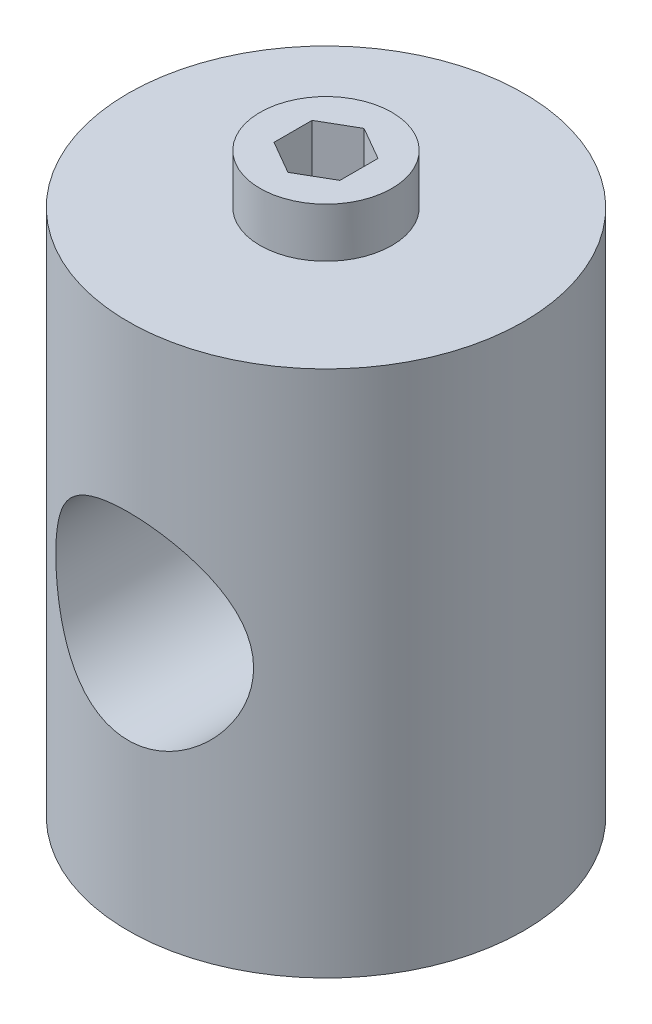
ISO-10303-21;
HEADER;
FILE_DESCRIPTION(('STEP AP214'),'2;1');
FILE_NAME('part.step','',(''),(''),'','','');
FILE_SCHEMA(('AUTOMOTIVE_DESIGN { 1 0 10303 214 1 1 1 1 }'));
ENDSEC;
DATA;
#1=APPLICATION_CONTEXT('core data for automotive mechanical design processes');
#2=APPLICATION_PROTOCOL_DEFINITION('international standard','automotive_design',2000,#1);
#3=PRODUCT_CONTEXT('',#1,'mechanical');
#4=PRODUCT('Part','Part','',(#3));
#5=PRODUCT_RELATED_PRODUCT_CATEGORY('part','',(#4));
#6=PRODUCT_DEFINITION_FORMATION('','',#4);
#7=PRODUCT_DEFINITION_CONTEXT('part definition',#1,'design');
#8=PRODUCT_DEFINITION('design','',#6,#7);
#9=PRODUCT_DEFINITION_SHAPE('','',#8);
#10=(LENGTH_UNIT() NAMED_UNIT(*) SI_UNIT(.MILLI.,.METRE.));
#11=(NAMED_UNIT(*) PLANE_ANGLE_UNIT() SI_UNIT($,.RADIAN.));
#12=(NAMED_UNIT(*) SI_UNIT($,.STERADIAN.) SOLID_ANGLE_UNIT());
#13=UNCERTAINTY_MEASURE_WITH_UNIT(LENGTH_MEASURE(1.E-05),#10,'distance_accuracy_value','');
#14=(GEOMETRIC_REPRESENTATION_CONTEXT(3) GLOBAL_UNCERTAINTY_ASSIGNED_CONTEXT((#13)) GLOBAL_UNIT_ASSIGNED_CONTEXT((#10,
#11,#12)) REPRESENTATION_CONTEXT('',''));
#15=CARTESIAN_POINT('',(0.,0.,0.));
#16=DIRECTION('',(0.,0.,1.));
#17=DIRECTION('',(1.,0.,0.));
#18=AXIS2_PLACEMENT_3D('',#15,#16,#17);
#19=CARTESIAN_POINT('',(-1.,8.,0.577350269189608));
#20=DIRECTION('',(0.,-1.,0.));
#21=DIRECTION('',(0.,0.,-1.));
#22=AXIS2_PLACEMENT_3D('',#19,#20,#21);
#23=PLANE('',#22);
#24=DIRECTION('',(0.866025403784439,0.,0.5));
#25=VECTOR('',#24,1.);
#26=CARTESIAN_POINT('',(-1.,8.,0.577350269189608));
#27=LINE('',#26,#25);
#28=CARTESIAN_POINT('',(-1.,8.,0.577350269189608));
#29=VERTEX_POINT('',#28);
#30=CARTESIAN_POINT('',(0.,8.,1.15470053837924));
#31=VERTEX_POINT('',#30);
#32=EDGE_CURVE('E103',#29,#31,#27,.T.);
#33=ORIENTED_EDGE('',*,*,#32,.T.);
#34=DIRECTION('',(0.866025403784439,0.,-0.5));
#35=VECTOR('',#34,1.);
#36=CARTESIAN_POINT('',(0.,8.,1.15470053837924));
#37=LINE('',#36,#35);
#38=CARTESIAN_POINT('',(1.,8.,0.577350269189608));
#39=VERTEX_POINT('',#38);
#40=EDGE_CURVE('E105',#31,#39,#37,.T.);
#41=ORIENTED_EDGE('',*,*,#40,.T.);
#42=DIRECTION('',(0.,0.,-1.));
#43=VECTOR('',#42,1.);
#44=CARTESIAN_POINT('',(1.,8.,0.577350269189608));
#45=LINE('',#44,#43);
#46=CARTESIAN_POINT('',(1.,8.,-0.577350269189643));
#47=VERTEX_POINT('',#46);
#48=EDGE_CURVE('E78',#39,#47,#45,.T.);
#49=ORIENTED_EDGE('',*,*,#48,.T.);
#50=DIRECTION('',(-0.866025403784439,0.,-0.5));
#51=VECTOR('',#50,1.);
#52=CARTESIAN_POINT('',(1.,8.,-0.577350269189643));
#53=LINE('',#52,#51);
#54=CARTESIAN_POINT('',(0.,8.,-1.15470053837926));
#55=VERTEX_POINT('',#54);
#56=EDGE_CURVE('E108',#47,#55,#53,.T.);
#57=ORIENTED_EDGE('',*,*,#56,.T.);
#58=DIRECTION('',(-0.866025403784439,0.,0.5));
#59=VECTOR('',#58,1.);
#60=CARTESIAN_POINT('',(0.,8.,-1.15470053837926));
#61=LINE('',#60,#59);
#62=CARTESIAN_POINT('',(-1.,8.,-0.577350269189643));
#63=VERTEX_POINT('',#62);
#64=EDGE_CURVE('E110',#55,#63,#61,.T.);
#65=ORIENTED_EDGE('',*,*,#64,.T.);
#66=DIRECTION('',(0.,0.,1.));
#67=VECTOR('',#66,1.);
#68=CARTESIAN_POINT('',(-1.,8.,-0.577350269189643));
#69=LINE('',#68,#67);
#70=EDGE_CURVE('E38',#63,#29,#69,.T.);
#71=ORIENTED_EDGE('',*,*,#70,.T.);
#72=EDGE_LOOP('',(#33,#41,#49,#57,#65,#71));
#73=FACE_BOUND('',#72,.T.);
#74=ADVANCED_FACE('F14',(#73),#23,.F.);
#75=CARTESIAN_POINT('',(0.,8.,1.15470053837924));
#76=DIRECTION('',(0.5,0.,0.866025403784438));
#77=DIRECTION('',(0.866025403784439,0.,-0.5));
#78=AXIS2_PLACEMENT_3D('',#75,#76,#77);
#79=PLANE('',#78);
#80=DIRECTION('',(0.866025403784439,0.,-0.5));
#81=VECTOR('',#80,1.);
#82=CARTESIAN_POINT('',(0.,9.5,1.15470053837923));
#83=LINE('',#82,#81);
#84=CARTESIAN_POINT('',(0.,9.5,1.15470053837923));
#85=VERTEX_POINT('',#84);
#86=CARTESIAN_POINT('',(1.,9.5,0.577350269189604));
#87=VERTEX_POINT('',#86);
#88=EDGE_CURVE('E84',#85,#87,#83,.T.);
#89=ORIENTED_EDGE('',*,*,#88,.T.);
#90=DIRECTION('',(0.,1.,0.));
#91=VECTOR('',#90,1.);
#92=CARTESIAN_POINT('',(1.,8.,0.577350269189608));
#93=LINE('',#92,#91);
#94=EDGE_CURVE('E71',#39,#87,#93,.T.);
#95=ORIENTED_EDGE('',*,*,#94,.F.);
#96=ORIENTED_EDGE('',*,*,#40,.F.);
#97=DIRECTION('',(0.,1.,0.));
#98=VECTOR('',#97,1.);
#99=CARTESIAN_POINT('',(0.,8.,1.15470053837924));
#100=LINE('',#99,#98);
#101=EDGE_CURVE('E81',#31,#85,#100,.T.);
#102=ORIENTED_EDGE('',*,*,#101,.T.);
#103=EDGE_LOOP('',(#89,#95,#96,#102));
#104=FACE_BOUND('',#103,.T.);
#105=ADVANCED_FACE('F85',(#104),#79,.F.);
#106=CARTESIAN_POINT('',(1.,8.,0.577350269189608));
#107=DIRECTION('',(1.,0.,0.));
#108=DIRECTION('',(0.,0.,-1.));
#109=AXIS2_PLACEMENT_3D('',#106,#107,#108);
#110=PLANE('',#109);
#111=DIRECTION('',(0.,0.,-1.));
#112=VECTOR('',#111,1.);
#113=CARTESIAN_POINT('',(1.,9.5,0.577350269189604));
#114=LINE('',#113,#112);
#115=CARTESIAN_POINT('',(1.,9.5,-0.577350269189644));
#116=VERTEX_POINT('',#115);
#117=EDGE_CURVE('E76',#87,#116,#114,.T.);
#118=ORIENTED_EDGE('',*,*,#117,.T.);
#119=DIRECTION('',(0.,1.,0.));
#120=VECTOR('',#119,1.);
#121=CARTESIAN_POINT('',(1.,8.,-0.577350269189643));
#122=LINE('',#121,#120);
#123=EDGE_CURVE('E80',#47,#116,#122,.T.);
#124=ORIENTED_EDGE('',*,*,#123,.F.);
#125=ORIENTED_EDGE('',*,*,#48,.F.);
#126=ORIENTED_EDGE('',*,*,#94,.T.);
#127=EDGE_LOOP('',(#118,#124,#125,#126));
#128=FACE_BOUND('',#127,.T.);
#129=ADVANCED_FACE('F73',(#128),#110,.F.);
#130=CARTESIAN_POINT('',(1.,8.,-0.577350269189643));
#131=DIRECTION('',(0.5,0.,-0.866025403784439));
#132=DIRECTION('',(-0.866025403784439,0.,-0.5));
#133=AXIS2_PLACEMENT_3D('',#130,#131,#132);
#134=PLANE('',#133);
#135=DIRECTION('',(-0.866025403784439,0.,-0.5));
#136=VECTOR('',#135,1.);
#137=CARTESIAN_POINT('',(1.,9.5,-0.577350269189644));
#138=LINE('',#137,#136);
#139=CARTESIAN_POINT('',(0.,9.5,-1.15470053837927));
#140=VERTEX_POINT('',#139);
#141=EDGE_CURVE('E92',#116,#140,#138,.T.);
#142=ORIENTED_EDGE('',*,*,#141,.T.);
#143=DIRECTION('',(0.,1.,0.));
#144=VECTOR('',#143,1.);
#145=CARTESIAN_POINT('',(0.,8.,-1.15470053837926));
#146=LINE('',#145,#144);
#147=EDGE_CURVE('E117',#55,#140,#146,.T.);
#148=ORIENTED_EDGE('',*,*,#147,.F.);
#149=ORIENTED_EDGE('',*,*,#56,.F.);
#150=ORIENTED_EDGE('',*,*,#123,.T.);
#151=EDGE_LOOP('',(#142,#148,#149,#150));
#152=FACE_BOUND('',#151,.T.);
#153=ADVANCED_FACE('F162',(#152),#134,.F.);
#154=CARTESIAN_POINT('',(0.,8.,-1.15470053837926));
#155=DIRECTION('',(-0.5,0.,-0.866025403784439));
#156=DIRECTION('',(-0.866025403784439,0.,0.5));
#157=AXIS2_PLACEMENT_3D('',#154,#155,#156);
#158=PLANE('',#157);
#159=DIRECTION('',(-0.866025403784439,0.,0.5));
#160=VECTOR('',#159,1.);
#161=CARTESIAN_POINT('',(0.,9.5,-1.15470053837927));
#162=LINE('',#161,#160);
#163=CARTESIAN_POINT('',(-1.,9.5,-0.577350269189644));
#164=VERTEX_POINT('',#163);
#165=EDGE_CURVE('E94',#140,#164,#162,.T.);
#166=ORIENTED_EDGE('',*,*,#165,.T.);
#167=DIRECTION('',(0.,1.,0.));
#168=VECTOR('',#167,1.);
#169=CARTESIAN_POINT('',(-1.,8.,-0.577350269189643));
#170=LINE('',#169,#168);
#171=EDGE_CURVE('E115',#63,#164,#170,.T.);
#172=ORIENTED_EDGE('',*,*,#171,.F.);
#173=ORIENTED_EDGE('',*,*,#64,.F.);
#174=ORIENTED_EDGE('',*,*,#147,.T.);
#175=EDGE_LOOP('',(#166,#172,#173,#174));
#176=FACE_BOUND('',#175,.T.);
#177=ADVANCED_FACE('F158',(#176),#158,.F.);
#178=CARTESIAN_POINT('',(-1.,8.,0.577350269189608));
#179=DIRECTION('',(-0.5,0.,0.866025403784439));
#180=DIRECTION('',(0.866025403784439,0.,0.5));
#181=AXIS2_PLACEMENT_3D('',#178,#179,#180);
#182=PLANE('',#181);
#183=DIRECTION('',(0.866025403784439,0.,0.5));
#184=VECTOR('',#183,1.);
#185=CARTESIAN_POINT('',(-1.,9.5,0.577350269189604));
#186=LINE('',#185,#184);
#187=CARTESIAN_POINT('',(-1.,9.5,0.577350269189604));
#188=VERTEX_POINT('',#187);
#189=EDGE_CURVE('E30',#188,#85,#186,.T.);
#190=ORIENTED_EDGE('',*,*,#189,.T.);
#191=ORIENTED_EDGE('',*,*,#101,.F.);
#192=ORIENTED_EDGE('',*,*,#32,.F.);
#193=DIRECTION('',(0.,1.,0.));
#194=VECTOR('',#193,1.);
#195=CARTESIAN_POINT('',(-1.,8.,0.577350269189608));
#196=LINE('',#195,#194);
#197=EDGE_CURVE('E113',#29,#188,#196,.T.);
#198=ORIENTED_EDGE('',*,*,#197,.T.);
#199=EDGE_LOOP('',(#190,#191,#192,#198));
#200=FACE_BOUND('',#199,.T.);
#201=ADVANCED_FACE('F161',(#200),#182,.F.);
#202=CARTESIAN_POINT('',(0.,9.5,0.));
#203=DIRECTION('',(0.,-1.,0.));
#204=DIRECTION('',(0.,0.,-1.));
#205=AXIS2_PLACEMENT_3D('',#202,#203,#204);
#206=PLANE('',#205);
#207=ORIENTED_EDGE('',*,*,#88,.F.);
#208=ORIENTED_EDGE('',*,*,#189,.F.);
#209=DIRECTION('',(0.,0.,1.));
#210=VECTOR('',#209,1.);
#211=CARTESIAN_POINT('',(-1.,9.5,-0.577350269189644));
#212=LINE('',#211,#210);
#213=EDGE_CURVE('E100',#164,#188,#212,.T.);
#214=ORIENTED_EDGE('',*,*,#213,.F.);
#215=ORIENTED_EDGE('',*,*,#165,.F.);
#216=ORIENTED_EDGE('',*,*,#141,.F.);
#217=ORIENTED_EDGE('',*,*,#117,.F.);
#218=EDGE_LOOP('',(#207,#208,#214,#215,#216,#217));
#219=FACE_BOUND('',#218,.T.);
#220=CARTESIAN_POINT('',(0.,9.5,0.));
#221=DIRECTION('',(0.,-1.,0.));
#222=DIRECTION('',(0.,0.,-1.));
#223=AXIS2_PLACEMENT_3D('',#220,#221,#222);
#224=CIRCLE('',#223,2.);
#225=CARTESIAN_POINT('',(0.,9.5,-2.00000000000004));
#226=VERTEX_POINT('',#225);
#227=EDGE_CURVE('E23',#226,#226,#224,.T.);
#228=ORIENTED_EDGE('',*,*,#227,.F.);
#229=EDGE_LOOP('',(#228));
#230=FACE_BOUND('',#229,.T.);
#231=ADVANCED_FACE('F88',(#219,#230),#206,.F.);
#232=CARTESIAN_POINT('',(-1.,8.,-0.577350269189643));
#233=DIRECTION('',(-1.,0.,0.));
#234=DIRECTION('',(0.,0.,1.));
#235=AXIS2_PLACEMENT_3D('',#232,#233,#234);
#236=PLANE('',#235);
#237=ORIENTED_EDGE('',*,*,#213,.T.);
#238=ORIENTED_EDGE('',*,*,#197,.F.);
#239=ORIENTED_EDGE('',*,*,#70,.F.);
#240=ORIENTED_EDGE('',*,*,#171,.T.);
#241=EDGE_LOOP('',(#237,#238,#239,#240));
#242=FACE_BOUND('',#241,.T.);
#243=ADVANCED_FACE('F153',(#242),#236,.F.);
#244=CARTESIAN_POINT('',(0.,5.5,0.));
#245=DIRECTION('',(0.,-1.,0.));
#246=DIRECTION('',(0.,0.,-1.));
#247=AXIS2_PLACEMENT_3D('',#244,#245,#246);
#248=CYLINDRICAL_SURFACE('',#247,2.);
#249=ORIENTED_EDGE('',*,*,#227,.T.);
#250=EDGE_LOOP('',(#249));
#251=FACE_BOUND('',#250,.T.);
#252=CARTESIAN_POINT('',(0.,8.,0.));
#253=DIRECTION('',(0.,-1.,0.));
#254=DIRECTION('',(0.,0.,1.));
#255=AXIS2_PLACEMENT_3D('',#252,#253,#254);
#256=CIRCLE('',#255,2.);
#257=CARTESIAN_POINT('',(0.,8.,1.99999999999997));
#258=VERTEX_POINT('',#257);
#259=EDGE_CURVE('E9',#258,#258,#256,.T.);
#260=ORIENTED_EDGE('',*,*,#259,.F.);
#261=EDGE_LOOP('',(#260));
#262=FACE_BOUND('',#261,.T.);
#263=ADVANCED_FACE('F156',(#251,#262),#248,.T.);
#264=CARTESIAN_POINT('',(0.,-8.,0.));
#265=DIRECTION('',(0.,-1.,0.));
#266=DIRECTION('',(1.,0.,0.));
#267=AXIS2_PLACEMENT_3D('',#264,#265,#266);
#268=PLANE('',#267);
#269=CARTESIAN_POINT('',(0.,-8.,0.));
#270=DIRECTION('',(0.,1.,0.));
#271=DIRECTION('',(-1.,0.,0.));
#272=AXIS2_PLACEMENT_3D('',#269,#270,#271);
#273=CIRCLE('',#272,6.);
#274=CARTESIAN_POINT('',(-6.,-8.,0.));
#275=VERTEX_POINT('',#274);
#276=EDGE_CURVE('E123',#275,#275,#273,.T.);
#277=ORIENTED_EDGE('',*,*,#276,.F.);
#278=EDGE_LOOP('',(#277));
#279=FACE_BOUND('',#278,.T.);
#280=ADVANCED_FACE('F177',(#279),#268,.T.);
#281=CARTESIAN_POINT('',(0.,-8.,0.));
#282=DIRECTION('',(0.,1.,0.));
#283=DIRECTION('',(-1.,0.,0.));
#284=AXIS2_PLACEMENT_3D('',#281,#282,#283);
#285=CYLINDRICAL_SURFACE('',#284,6.);
#286=CARTESIAN_POINT('',(0.,3.,6.));
#287=CARTESIAN_POINT('',(0.0788941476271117,2.99999916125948,5.99999934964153));
#288=CARTESIAN_POINT('',(0.157796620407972,2.99688205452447,5.99843869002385));
#289=CARTESIAN_POINT('',(0.315001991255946,2.98446072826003,5.99224358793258));
#290=CARTESIAN_POINT('',(0.393304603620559,2.97515372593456,5.98760776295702));
#291=CARTESIAN_POINT('',(0.626628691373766,2.93804214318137,5.96921978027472));
#292=CARTESIAN_POINT('',(0.779952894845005,2.90104717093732,5.95098734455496));
#293=CARTESIAN_POINT('',(1.07683586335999,2.80441822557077,5.90448966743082));
#294=CARTESIAN_POINT('',(1.22043005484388,2.74487223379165,5.87626344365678));
#295=CARTESIAN_POINT('',(1.49540820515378,2.60528874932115,5.81237302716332));
#296=CARTESIAN_POINT('',(1.62679312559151,2.5252528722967,5.77670942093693));
#297=CARTESIAN_POINT('',(1.8825270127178,2.34144601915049,5.6986875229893));
#298=CARTESIAN_POINT('',(2.00596945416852,2.23653205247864,5.65605474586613));
#299=CARTESIAN_POINT('',(2.23433451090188,2.00844407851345,5.5698003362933));
#300=CARTESIAN_POINT('',(2.33924301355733,1.88525628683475,5.52617797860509));
#301=CARTESIAN_POINT('',(2.53576864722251,1.61251563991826,5.43896347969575));
#302=CARTESIAN_POINT('',(2.62572411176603,1.46165902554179,5.39563602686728));
#303=CARTESIAN_POINT('',(2.74034031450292,1.22404914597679,5.33782449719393));
#304=CARTESIAN_POINT('',(2.7751678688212,1.14292907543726,5.31974570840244));
#305=CARTESIAN_POINT('',(2.83769299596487,0.977399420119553,5.28665768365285));
#306=CARTESIAN_POINT('',(2.86539478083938,0.89299181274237,5.27164663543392));
#307=CARTESIAN_POINT('',(2.91188280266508,0.726604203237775,5.24610341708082));
#308=CARTESIAN_POINT('',(2.93110042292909,0.644777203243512,5.23535838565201));
#309=CARTESIAN_POINT('',(2.96263559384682,0.479445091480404,5.21757784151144));
#310=CARTESIAN_POINT('',(2.97495680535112,0.395940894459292,5.21054036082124));
#311=CARTESIAN_POINT('',(2.99251382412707,0.227993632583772,5.2004775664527));
#312=CARTESIAN_POINT('',(2.9977538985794,0.14355116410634,5.19744983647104));
#313=CARTESIAN_POINT('',(3.00108452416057,-0.0254936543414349,5.1955255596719));
#314=CARTESIAN_POINT('',(2.99917575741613,-0.110095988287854,5.1966286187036));
#315=CARTESIAN_POINT('',(2.98404973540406,-0.342753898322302,5.20534668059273));
#316=CARTESIAN_POINT('',(2.96335042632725,-0.490244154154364,5.21726794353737));
#317=CARTESIAN_POINT('',(2.90082280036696,-0.779193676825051,5.25228182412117));
#318=CARTESIAN_POINT('',(2.85898775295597,-0.920651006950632,5.27537800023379));
#319=CARTESIAN_POINT('',(2.75462843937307,-1.19767965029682,5.33062568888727));
#320=CARTESIAN_POINT('',(2.69164495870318,-1.33303711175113,5.36297559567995));
#321=CARTESIAN_POINT('',(2.54712530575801,-1.59190496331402,5.43310175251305));
#322=CARTESIAN_POINT('',(2.46558080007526,-1.71540999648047,5.4708804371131));
#323=CARTESIAN_POINT('',(2.27419808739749,-1.9635630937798,5.55339485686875));
#324=CARTESIAN_POINT('',(2.16208335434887,-2.08637044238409,5.59840533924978));
#325=CARTESIAN_POINT('',(1.91866675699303,-2.31220643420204,5.68642866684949));
#326=CARTESIAN_POINT('',(1.78735577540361,-2.41522562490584,5.72944054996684));
#327=CARTESIAN_POINT('',(1.50154951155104,-2.60305693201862,5.8110596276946));
#328=CARTESIAN_POINT('',(1.34626077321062,-2.68680140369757,5.84936952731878));
#329=CARTESIAN_POINT('',(1.02139864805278,-2.8262911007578,5.91473643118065));
#330=CARTESIAN_POINT('',(0.851836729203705,-2.88205855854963,5.94180236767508));
#331=CARTESIAN_POINT('',(0.518299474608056,-2.95942620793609,5.97973001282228));
#332=CARTESIAN_POINT('',(0.355024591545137,-2.98347370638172,5.99174814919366));
#333=CARTESIAN_POINT('',(0.0263387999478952,-3.00439419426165,6.00219040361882));
#334=CARTESIAN_POINT('',(-0.139071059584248,-3.0012800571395,6.00062096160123));
#335=CARTESIAN_POINT('',(-0.453698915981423,-2.96937993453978,5.98473576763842));
#336=CARTESIAN_POINT('',(-0.603178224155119,-2.94260240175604,5.97141737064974));
#337=CARTESIAN_POINT('',(-0.895220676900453,-2.86728578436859,5.93466513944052));
#338=CARTESIAN_POINT('',(-1.03778305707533,-2.81874430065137,5.91123019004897));
#339=CARTESIAN_POINT('',(-1.31666582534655,-2.70000460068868,5.85552754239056));
#340=CARTESIAN_POINT('',(-1.45269119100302,-2.6292268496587,5.82302645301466));
#341=CARTESIAN_POINT('',(-1.71138408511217,-2.4686773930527,5.75231922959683));
#342=CARTESIAN_POINT('',(-1.83404588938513,-2.37889759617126,5.71411066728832));
#343=CARTESIAN_POINT('',(-2.07530306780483,-2.17271872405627,5.63124663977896));
#344=CARTESIAN_POINT('',(-2.19231623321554,-2.0545713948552,5.58632654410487));
#345=CARTESIAN_POINT('',(-2.40556896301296,-1.80022454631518,5.49787174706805));
#346=CARTESIAN_POINT('',(-2.50179415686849,-1.66401264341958,5.45433802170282));
#347=CARTESIAN_POINT('',(-2.67512374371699,-1.36906903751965,5.37153576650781));
#348=CARTESIAN_POINT('',(-2.75107648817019,-1.20956620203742,5.33257588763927));
#349=CARTESIAN_POINT('',(-2.87424847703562,-0.877469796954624,5.26722216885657));
#350=CARTESIAN_POINT('',(-2.92150474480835,-0.704893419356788,5.24081214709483));
#351=CARTESIAN_POINT('',(-2.98158506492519,-0.36926933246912,5.20684503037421));
#352=CARTESIAN_POINT('',(-2.99727899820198,-0.206897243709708,5.19772150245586));
#353=CARTESIAN_POINT('',(-3.00206745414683,0.118341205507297,5.19496064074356));
#354=CARTESIAN_POINT('',(-2.99117350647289,0.281207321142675,5.20131659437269));
#355=CARTESIAN_POINT('',(-2.94577840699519,0.586450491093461,5.22713585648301));
#356=CARTESIAN_POINT('',(-2.91362505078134,0.729301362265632,5.24529281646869));
#357=CARTESIAN_POINT('',(-2.82952596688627,1.00742440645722,5.29113050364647));
#358=CARTESIAN_POINT('',(-2.77757387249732,1.14269412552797,5.31881429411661));
#359=CARTESIAN_POINT('',(-2.65144766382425,1.41187436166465,5.38285583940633));
#360=CARTESIAN_POINT('',(-2.57601505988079,1.54508296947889,5.41967139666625));
#361=CARTESIAN_POINT('',(-2.40645126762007,1.79782434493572,5.49706022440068));
#362=CARTESIAN_POINT('',(-2.31231035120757,1.91734994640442,5.53763544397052));
#363=CARTESIAN_POINT('',(-2.09461689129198,2.15442285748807,5.62386853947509));
#364=CARTESIAN_POINT('',(-1.96888052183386,2.26996512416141,5.66954494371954));
#365=CARTESIAN_POINT('',(-1.69843715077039,2.47880114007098,5.75633712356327));
#366=CARTESIAN_POINT('',(-1.55371998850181,2.5720828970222,5.79745043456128));
#367=CARTESIAN_POINT('',(-1.3245233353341,2.6931781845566,5.85251406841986));
#368=CARTESIAN_POINT('',(-1.24575314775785,2.73052020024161,5.86982524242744));
#369=CARTESIAN_POINT('',(-1.08479725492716,2.7983616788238,5.90168845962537));
#370=CARTESIAN_POINT('',(-1.00261324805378,2.82886449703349,5.91624185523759));
#371=CARTESIAN_POINT('',(-0.835616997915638,2.88260725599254,5.94212690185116));
#372=CARTESIAN_POINT('',(-0.75081094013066,2.90586304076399,5.95346557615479));
#373=CARTESIAN_POINT('',(-0.57914235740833,2.94488257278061,5.9726077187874));
#374=CARTESIAN_POINT('',(-0.492281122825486,2.96065089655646,5.9804133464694));
#375=CARTESIAN_POINT('',(-0.33782489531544,2.9816846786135,5.99085829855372));
#376=CARTESIAN_POINT('',(-0.270495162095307,2.98854691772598,5.99428035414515));
#377=CARTESIAN_POINT('',(-0.135445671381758,2.99770500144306,5.99885151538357));
#378=CARTESIAN_POINT('',(-0.0677259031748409,3.00000072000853,6.00000055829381));
#379=CARTESIAN_POINT('',(0.,3.,6.));
#380=B_SPLINE_CURVE_WITH_KNOTS('',3,(#286,#287,#288,#289,#290,#291,#292,#293,#294,#295,#296,
#297,#298,#299,#300,#301,#302,#303,#304,#305,#306,#307,#308,#309,#310,#311,#312,#313,#314,#315,
#316,#317,#318,#319,#320,#321,#322,#323,#324,#325,#326,#327,#328,#329,#330,#331,#332,#333,#334,
#335,#336,#337,#338,#339,#340,#341,#342,#343,#344,#345,#346,#347,#348,#349,#350,#351,#352,#353,
#354,#355,#356,#357,#358,#359,#360,#361,#362,#363,#364,#365,#366,#367,#368,#369,#370,#371,#372,
#373,#374,#375,#376,#377,#378,#379),.UNSPECIFIED.,.T.,.F.,(4,2,2,2,2,2,2,2,2,2,2,2,2,2,2,2,2,2,
2,2,2,2,2,2,2,2,2,2,2,2,2,2,2,2,2,2,2,2,2,2,2,2,2,2,2,2,4),(0.,0.236611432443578,
0.473329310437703,0.947100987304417,1.41904300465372,1.89094781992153,2.3914018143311,
2.89223525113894,3.43190833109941,3.70192714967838,3.97178599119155,4.2256372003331,
4.47935352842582,4.73291689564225,4.98645606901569,5.43238672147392,5.87845946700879,
6.33492255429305,6.79159098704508,7.30616358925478,7.82098138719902,8.35970601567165,
8.89800185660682,9.3917140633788,9.88519228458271,10.3404225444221,10.7957029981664,
11.2640010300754,11.7324988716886,12.2470036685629,12.7618630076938,13.3016558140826,
13.8407507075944,14.3280945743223,14.8152271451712,15.2559532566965,15.6968212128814,
16.1673090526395,16.6380421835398,17.1659726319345,17.6941868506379,17.9605054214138,
18.2266930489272,18.4922945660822,18.7577335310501,18.9608446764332,19.1639614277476),.UNSPECIFIED.);
#381=CARTESIAN_POINT('',(0.,3.,6.));
#382=VERTEX_POINT('',#381);
#383=EDGE_CURVE('E131',#382,#382,#380,.T.);
#384=ORIENTED_EDGE('',*,*,#383,.T.);
#385=EDGE_LOOP('',(#384));
#386=FACE_BOUND('',#385,.T.);
#387=CARTESIAN_POINT('',(0.,8.,0.));
#388=DIRECTION('',(0.,1.,0.));
#389=DIRECTION('',(-1.,0.,0.));
#390=AXIS2_PLACEMENT_3D('',#387,#388,#389);
#391=CIRCLE('',#390,6.);
#392=CARTESIAN_POINT('',(-6.,8.,0.));
#393=VERTEX_POINT('',#392);
#394=EDGE_CURVE('E125',#393,#393,#391,.T.);
#395=ORIENTED_EDGE('',*,*,#394,.F.);
#396=EDGE_LOOP('',(#395));
#397=FACE_BOUND('',#396,.T.);
#398=ORIENTED_EDGE('',*,*,#276,.T.);
#399=EDGE_LOOP('',(#398));
#400=FACE_BOUND('',#399,.T.);
#401=CARTESIAN_POINT('',(0.,3.,-6.));
#402=CARTESIAN_POINT('',(-0.078894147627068,2.99999916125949,-5.99999934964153));
#403=CARTESIAN_POINT('',(-0.157796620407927,2.99688205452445,-5.99843869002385));
#404=CARTESIAN_POINT('',(-0.315001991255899,2.98446072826,-5.99224358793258));
#405=CARTESIAN_POINT('',(-0.393304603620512,2.97515372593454,-5.98760776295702));
#406=CARTESIAN_POINT('',(-0.626628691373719,2.93804214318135,-5.96921978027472));
#407=CARTESIAN_POINT('',(-0.779952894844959,2.9010471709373,-5.95098734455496));
#408=CARTESIAN_POINT('',(-1.07683586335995,2.80441822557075,-5.90448966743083));
#409=CARTESIAN_POINT('',(-1.22043005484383,2.74487223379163,-5.87626344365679));
#410=CARTESIAN_POINT('',(-1.49540820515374,2.60528874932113,-5.81237302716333));
#411=CARTESIAN_POINT('',(-1.62679312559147,2.52525287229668,-5.77670942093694));
#412=CARTESIAN_POINT('',(-1.88252701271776,2.34144601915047,-5.69868752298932));
#413=CARTESIAN_POINT('',(-2.00596945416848,2.23653205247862,-5.65605474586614));
#414=CARTESIAN_POINT('',(-2.23433451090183,2.00844407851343,-5.56980033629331));
#415=CARTESIAN_POINT('',(-2.33924301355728,1.88525628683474,-5.5261779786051));
#416=CARTESIAN_POINT('',(-2.53576864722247,1.61251563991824,-5.43896347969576));
#417=CARTESIAN_POINT('',(-2.62572411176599,1.46165902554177,-5.3956360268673));
#418=CARTESIAN_POINT('',(-2.74034031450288,1.22404914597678,-5.33782449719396));
#419=CARTESIAN_POINT('',(-2.77516786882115,1.14292907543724,-5.31974570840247));
#420=CARTESIAN_POINT('',(-2.83769299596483,0.977399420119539,-5.28665768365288));
#421=CARTESIAN_POINT('',(-2.86539478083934,0.892991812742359,-5.27164663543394));
#422=CARTESIAN_POINT('',(-2.91188280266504,0.726604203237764,-5.24610341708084));
#423=CARTESIAN_POINT('',(-2.93110042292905,0.644777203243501,-5.23535838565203));
#424=CARTESIAN_POINT('',(-2.96263559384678,0.479445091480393,-5.21757784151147));
#425=CARTESIAN_POINT('',(-2.97495680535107,0.395940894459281,-5.21054036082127));
#426=CARTESIAN_POINT('',(-2.99251382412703,0.227993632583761,-5.20047756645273));
#427=CARTESIAN_POINT('',(-2.99775389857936,0.143551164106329,-5.19744983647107));
#428=CARTESIAN_POINT('',(-3.00108452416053,-0.0254936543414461,-5.19552555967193));
#429=CARTESIAN_POINT('',(-2.99917575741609,-0.110095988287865,-5.19662861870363));
#430=CARTESIAN_POINT('',(-2.98404973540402,-0.342753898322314,-5.20534668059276));
#431=CARTESIAN_POINT('',(-2.96335042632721,-0.490244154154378,-5.2172679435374));
#432=CARTESIAN_POINT('',(-2.90082280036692,-0.779193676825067,-5.25228182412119));
#433=CARTESIAN_POINT('',(-2.85898775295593,-0.920651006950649,-5.27537800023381));
#434=CARTESIAN_POINT('',(-2.75462843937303,-1.19767965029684,-5.33062568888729));
#435=CARTESIAN_POINT('',(-2.69164495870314,-1.33303711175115,-5.36297559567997));
#436=CARTESIAN_POINT('',(-2.54712530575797,-1.59190496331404,-5.43310175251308));
#437=CARTESIAN_POINT('',(-2.46558080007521,-1.71540999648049,-5.47088043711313));
#438=CARTESIAN_POINT('',(-2.27419808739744,-1.96356309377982,-5.55339485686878));
#439=CARTESIAN_POINT('',(-2.16208335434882,-2.08637044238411,-5.5984053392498));
#440=CARTESIAN_POINT('',(-1.91866675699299,-2.31220643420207,-5.6864286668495));
#441=CARTESIAN_POINT('',(-1.78735577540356,-2.41522562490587,-5.72944054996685));
#442=CARTESIAN_POINT('',(-1.50154951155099,-2.60305693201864,-5.81105962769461));
#443=CARTESIAN_POINT('',(-1.34626077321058,-2.68680140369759,-5.8493695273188));
#444=CARTESIAN_POINT('',(-1.02139864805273,-2.82629110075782,-5.91473643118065));
#445=CARTESIAN_POINT('',(-0.851836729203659,-2.88205855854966,-5.94180236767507));
#446=CARTESIAN_POINT('',(-0.51829947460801,-2.95942620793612,-5.97973001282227));
#447=CARTESIAN_POINT('',(-0.355024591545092,-2.98347370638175,-5.99174814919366));
#448=CARTESIAN_POINT('',(-0.0263387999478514,-3.00439419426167,-6.00219040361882));
#449=CARTESIAN_POINT('',(0.139071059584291,-3.00128005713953,-6.00062096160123));
#450=CARTESIAN_POINT('',(0.453698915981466,-2.9693799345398,-5.98473576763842));
#451=CARTESIAN_POINT('',(0.603178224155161,-2.94260240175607,-5.97141737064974));
#452=CARTESIAN_POINT('',(0.895220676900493,-2.86728578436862,-5.93466513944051));
#453=CARTESIAN_POINT('',(1.03778305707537,-2.8187443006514,-5.91123019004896));
#454=CARTESIAN_POINT('',(1.31666582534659,-2.70000460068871,-5.85552754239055));
#455=CARTESIAN_POINT('',(1.45269119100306,-2.62922684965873,-5.82302645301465));
#456=CARTESIAN_POINT('',(1.71138408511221,-2.46867739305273,-5.75231922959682));
#457=CARTESIAN_POINT('',(1.83404588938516,-2.37889759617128,-5.7141106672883));
#458=CARTESIAN_POINT('',(2.07530306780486,-2.17271872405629,-5.63124663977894));
#459=CARTESIAN_POINT('',(2.19231623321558,-2.05457139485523,-5.58632654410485));
#460=CARTESIAN_POINT('',(2.405568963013,-1.80022454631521,-5.49787174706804));
#461=CARTESIAN_POINT('',(2.50179415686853,-1.6640126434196,-5.4543380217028));
#462=CARTESIAN_POINT('',(2.67512374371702,-1.36906903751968,-5.37153576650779));
#463=CARTESIAN_POINT('',(2.75107648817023,-1.20956620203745,-5.33257588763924));
#464=CARTESIAN_POINT('',(2.87424847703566,-0.877469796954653,-5.26722216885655));
#465=CARTESIAN_POINT('',(2.92150474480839,-0.704893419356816,-5.24081214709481));
#466=CARTESIAN_POINT('',(2.98158506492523,-0.369269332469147,-5.20684503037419));
#467=CARTESIAN_POINT('',(2.99727899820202,-0.206897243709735,-5.19772150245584));
#468=CARTESIAN_POINT('',(3.00206745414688,0.118341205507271,-5.19496064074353));
#469=CARTESIAN_POINT('',(2.99117350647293,0.281207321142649,-5.20131659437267));
#470=CARTESIAN_POINT('',(2.94577840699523,0.586450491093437,-5.22713585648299));
#471=CARTESIAN_POINT('',(2.91362505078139,0.729301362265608,-5.24529281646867));
#472=CARTESIAN_POINT('',(2.82952596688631,1.00742440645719,-5.29113050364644));
#473=CARTESIAN_POINT('',(2.77757387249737,1.14269412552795,-5.31881429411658));
#474=CARTESIAN_POINT('',(2.6514476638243,1.41187436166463,-5.3828558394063));
#475=CARTESIAN_POINT('',(2.57601505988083,1.54508296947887,-5.41967139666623));
#476=CARTESIAN_POINT('',(2.40645126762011,1.79782434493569,-5.49706022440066));
#477=CARTESIAN_POINT('',(2.31231035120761,1.91734994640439,-5.5376354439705));
#478=CARTESIAN_POINT('',(2.09461689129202,2.15442285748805,-5.62386853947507));
#479=CARTESIAN_POINT('',(1.96888052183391,2.26996512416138,-5.66954494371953));
#480=CARTESIAN_POINT('',(1.69843715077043,2.47880114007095,-5.75633712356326));
#481=CARTESIAN_POINT('',(1.55371998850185,2.57208289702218,-5.79745043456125));
#482=CARTESIAN_POINT('',(1.32452333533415,2.69317818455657,-5.85251406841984));
#483=CARTESIAN_POINT('',(1.2457531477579,2.73052020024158,-5.86982524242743));
#484=CARTESIAN_POINT('',(1.08479725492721,2.79836167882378,-5.90168845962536));
#485=CARTESIAN_POINT('',(1.00261324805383,2.82886449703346,-5.91624185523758));
#486=CARTESIAN_POINT('',(0.83561699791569,2.88260725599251,-5.94212690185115));
#487=CARTESIAN_POINT('',(0.750810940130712,2.90586304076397,-5.95346557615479));
#488=CARTESIAN_POINT('',(0.579142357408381,2.94488257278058,-5.97260771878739));
#489=CARTESIAN_POINT('',(0.492281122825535,2.96065089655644,-5.98041334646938));
#490=CARTESIAN_POINT('',(0.337824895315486,2.98168467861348,-5.99085829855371));
#491=CARTESIAN_POINT('',(0.270495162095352,2.98854691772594,-5.99428035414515));
#492=CARTESIAN_POINT('',(0.135445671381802,2.99770500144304,-5.99885151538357));
#493=CARTESIAN_POINT('',(0.0677259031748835,3.00000072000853,-6.00000055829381));
#494=CARTESIAN_POINT('',(0.,3.,-6.));
#495=B_SPLINE_CURVE_WITH_KNOTS('',3,(#401,#402,#403,#404,#405,#406,#407,#408,#409,#410,#411,
#412,#413,#414,#415,#416,#417,#418,#419,#420,#421,#422,#423,#424,#425,#426,#427,#428,#429,#430,
#431,#432,#433,#434,#435,#436,#437,#438,#439,#440,#441,#442,#443,#444,#445,#446,#447,#448,#449,
#450,#451,#452,#453,#454,#455,#456,#457,#458,#459,#460,#461,#462,#463,#464,#465,#466,#467,#468,
#469,#470,#471,#472,#473,#474,#475,#476,#477,#478,#479,#480,#481,#482,#483,#484,#485,#486,#487,
#488,#489,#490,#491,#492,#493,#494),.UNSPECIFIED.,.T.,.F.,(4,2,2,2,2,2,2,2,2,2,2,2,2,2,2,2,2,2,
2,2,2,2,2,2,2,2,2,2,2,2,2,2,2,2,2,2,2,2,2,2,2,2,2,2,2,2,4),(0.,0.236611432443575,
0.473329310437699,0.947100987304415,1.41904300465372,1.89094781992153,2.39140181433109,
2.89223525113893,3.4319083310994,3.70192714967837,3.97178599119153,4.22563720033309,
4.4793535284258,4.73291689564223,4.98645606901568,5.4323867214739,5.87845946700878,
6.33492255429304,6.79159098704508,7.30616358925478,7.82098138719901,8.35970601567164,
8.89800185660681,9.39171406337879,9.8851922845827,10.3404225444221,10.7957029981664,
11.2640010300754,11.7324988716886,12.2470036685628,12.7618630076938,13.3016558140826,
13.8407507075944,14.3280945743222,14.8152271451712,15.2559532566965,15.6968212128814,
16.1673090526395,16.6380421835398,17.1659726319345,17.6941868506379,17.9605054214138,
18.2266930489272,18.4922945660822,18.7577335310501,18.9608446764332,19.1639614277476),.UNSPECIFIED.);
#496=CARTESIAN_POINT('',(0.,3.,-6.));
#497=VERTEX_POINT('',#496);
#498=EDGE_CURVE('E127',#497,#497,#495,.T.);
#499=ORIENTED_EDGE('',*,*,#498,.T.);
#500=EDGE_LOOP('',(#499));
#501=FACE_BOUND('',#500,.T.);
#502=ADVANCED_FACE('F16',(#386,#397,#400,#501),#285,.T.);
#503=CARTESIAN_POINT('',(0.,8.,0.));
#504=DIRECTION('',(0.,-1.,0.));
#505=DIRECTION('',(1.,0.,0.));
#506=AXIS2_PLACEMENT_3D('',#503,#504,#505);
#507=PLANE('',#506);
#508=ORIENTED_EDGE('',*,*,#394,.T.);
#509=EDGE_LOOP('',(#508));
#510=FACE_BOUND('',#509,.T.);
#511=ORIENTED_EDGE('',*,*,#259,.T.);
#512=EDGE_LOOP('',(#511));
#513=FACE_BOUND('',#512,.T.);
#514=ADVANCED_FACE('F148',(#510,#513),#507,.F.);
#515=CARTESIAN_POINT('',(0.,0.,-34.5));
#516=DIRECTION('',(0.,0.,1.));
#517=DIRECTION('',(0.,1.,0.));
#518=AXIS2_PLACEMENT_3D('',#515,#516,#517);
#519=CYLINDRICAL_SURFACE('',#518,3.);
#520=ORIENTED_EDGE('',*,*,#383,.F.);
#521=EDGE_LOOP('',(#520));
#522=FACE_BOUND('',#521,.T.);
#523=ORIENTED_EDGE('',*,*,#498,.F.);
#524=EDGE_LOOP('',(#523));
#525=FACE_BOUND('',#524,.T.);
#526=ADVANCED_FACE('F144',(#522,#525),#519,.F.);
#527=CLOSED_SHELL('',(#74,#105,#129,#153,#177,#201,#231,#243,#263,#280,#502,#514,#526));
#528=MANIFOLD_SOLID_BREP('B1',#527);
#529=ADVANCED_BREP_SHAPE_REPRESENTATION('',(#18,#528),#14);
#530=SHAPE_DEFINITION_REPRESENTATION(#9,#529);
ENDSEC;
END-ISO-10303-21;
